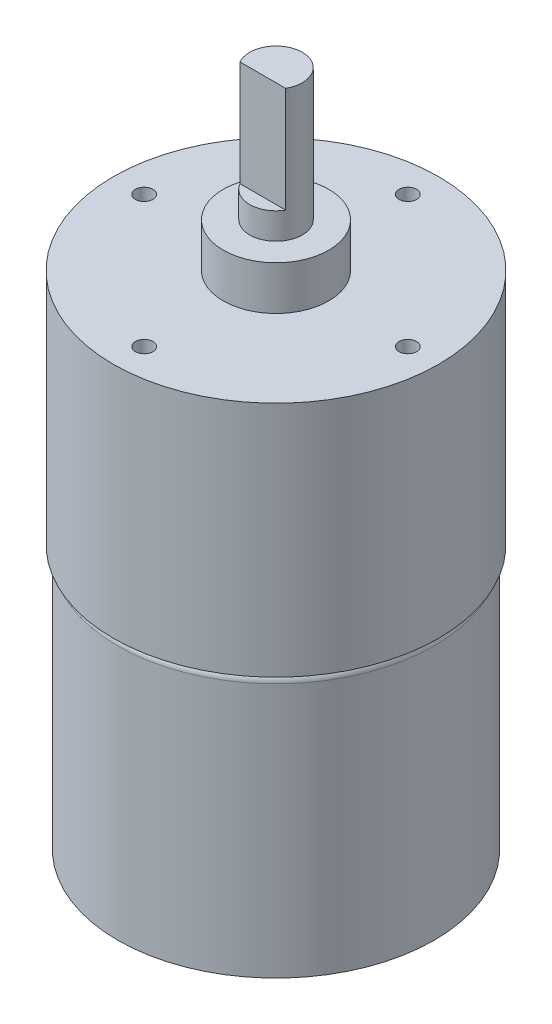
from build123d import *

# Parameters (mm, degrees)
SKETCH1_R               = 18
BOSS_EXTRUDE1_DEPTH     = 30
SKETCH2_R               = 17.5
CUT_EXTRUDE1_DEPTH      = 1
BOSS_EXTRUDE3_DEPTH     = 6
SKETCH3_3_R             = 0.5
BOSS_EXTRUDE4_DEPTH     = 0.5
CUT_EXTRUDE2_DEPTH      = 46.762976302
CUT_EXTRUDE2_DEPTH_BACK = 46.762976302
CHAMFER1_SIZE           = 0.1
FILLET1_R               = 1
SKETCH6_R               = 18.5
BOSS_EXTRUDE5_DEPTH     = 27
SKETCH7_R               = 6
BOSS_EXTRUDE6_DEPTH     = 5
SKETCH8_R               = 3
BOSS_EXTRUDE7_DEPTH     = 15
SKETCH9_W               = 5.196152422
SKETCH9_H               = 2
CUT_EXTRUDE3_DEPTH      = 12
SKETCH10_R              = 1
CUT_EXTRUDE4_DEPTH      = 12
CIRPATTERN1_COUNT       = 4


with BuildPart() as part:
    # Sketch1 → Boss-Extrude1 (new body)
    with BuildSketch(Plane(origin=(0, 0, 0), x_dir=(1, 0, 0), z_dir=(0, 1, 0))):
        with Locations(Location((0, 0, 0), (0, 0, 270))):
            Circle(SKETCH1_R)
    extrude(amount=BOSS_EXTRUDE1_DEPTH)

    # Sketch2 → Cut-Extrude1 (cut)
    with BuildSketch(Plane.XZ):
        with Locations(Location((0, 0, 0), (0, 0, 270))):
            Circle(SKETCH2_R)
    extrude(amount=-CUT_EXTRUDE1_DEPTH, mode=Mode.SUBTRACT)

    # Sketch3 → Boss-Extrude3 (add)
    with BuildSketch(Plane.XZ.offset(-1)):
        with BuildLine():
            Line((-10.5, -1.5), (-10.5, 1.5))
            ThreePointArc((-10.5, 1.5), (-11, 2), (-11.5, 1.5))
            Line((-11.5, 1.5), (-11.5, -1.5))
            ThreePointArc((-11.5, -1.5), (-11, -2), (-10.5, -1.5))
        make_face()
        with BuildLine():
            Line((11.5, -1.5), (11.5, 1.5))
            ThreePointArc((11.5, 1.5), (11, 2), (10.5, 1.5))
            Line((10.5, 1.5), (10.5, -1.5))
            ThreePointArc((10.5, -1.5), (11, -2), (11.5, -1.5))
        make_face()
    extrude(amount=BOSS_EXTRUDE3_DEPTH)

    # Sketch3_3 → Boss-Extrude4 (add)
    with BuildSketch(Plane.XZ.offset(-1)):
        with Locations(Location((10.5, 3, 0), (0, 0, 270))):
            Circle(SKETCH3_3_R)
        with Locations(Location((10.5, -3, 0), (0, 0, 90))):
            Circle(SKETCH3_3_R)
        with Locations(Location((-10.5, -3, 0), (0, 0, 270))):
            Circle(SKETCH3_3_R)
        with Locations(Location((-10.5, 3, 0), (0, 0, 90))):
            Circle(SKETCH3_3_R)
    extrude(amount=BOSS_EXTRUDE4_DEPTH)

    # Sketch4 → Cut-Extrude2 (cut, two sides: drawn at the far end of the back side and taken through both)
    with BuildSketch(Plane(origin=(11.5, 0, 0), x_dir=(0, 0, -1), z_dir=(1, 0, 0)).offset(-CUT_EXTRUDE2_DEPTH_BACK)):
        with BuildLine():
            Line((0.5, -1.75), (0.5, -3.25))
            ThreePointArc((0.5, -3.25), (0, -3.75), (-0.5, -3.25))
            Line((-0.5, -3.25), (-0.5, -1.75))
            ThreePointArc((-0.5, -1.75), (0, -1.25), (0.5, -1.75))
        make_face()
    extrude(amount=CUT_EXTRUDE2_DEPTH + CUT_EXTRUDE2_DEPTH_BACK, mode=Mode.SUBTRACT)

    # Chamfer1
    chamfer1_edges = [part.edges().sort_by_distance(p)[0] for p in [
        (-11.5, -5, 0),
        (-10.5, -5, 0),
        (-11, -5, 2),
        (-11, -5, -2),
        (10.5, -5, 0),
        (11.5, -5, 0),
        (11, -5, 2),
        (11, -5, -2),
    ]]
    chamfer(chamfer1_edges, length=CHAMFER1_SIZE)

    # Fillet1
    fillet1_edges = [part.edges().sort_by_distance(p)[0] for p in [
        (0, 30, -18),
    ]]
    fillet(fillet1_edges, radius=FILLET1_R)

    # Sketch6 → Boss-Extrude5 (add)
    with BuildSketch(Plane(origin=(0, 30, 0), x_dir=(1, 0, 0), z_dir=(0, 1, 0))):
        with Locations(Location((0, 0, 0), (0, 0, 270))):
            Circle(SKETCH6_R)
    extrude(amount=BOSS_EXTRUDE5_DEPTH)

    # Sketch7 → Boss-Extrude6 (add)
    with BuildSketch(Plane(origin=(0, 57, 0), x_dir=(1, 0, 0), z_dir=(0, 1, 0))):
        with Locations(Location((0, 0, 0), (0, 0, 270))):
            Circle(SKETCH7_R)
    extrude(amount=BOSS_EXTRUDE6_DEPTH)

    # Sketch8 → Boss-Extrude7 (add)
    with BuildSketch(Plane(origin=(0, 62, 0), x_dir=(1, 0, 0), z_dir=(0, 1, 0))):
        with Locations(Location((0, 0, 0), (0, 0, 270))):
            Circle(SKETCH8_R)
    extrude(amount=BOSS_EXTRUDE7_DEPTH)

    # Sketch9 → Cut-Extrude3 (cut)
    with BuildSketch(Plane(origin=(0, 77, 0), x_dir=(1, 0, 0), z_dir=(0, 1, 0))):
        with Locations((0, -2.5)):
            Rectangle(SKETCH9_W, SKETCH9_H)
    extrude(amount=-CUT_EXTRUDE3_DEPTH, mode=Mode.SUBTRACT)

    # Sketch10 → Cut-Extrude4 (cut)
    with BuildSketch(Plane(origin=(0, 57, 0), x_dir=(1, 0, 0), z_dir=(0, 1, 0))):
        with Locations(Location((0, 15, 0), (0, 0, 270))):
            Circle(SKETCH10_R)
    cut_extrude4 = extrude(amount=-CUT_EXTRUDE4_DEPTH, mode=Mode.SUBTRACT)

    # CirPattern1: Cut-Extrude4 ×4 about axis
    cirpattern1_axis = Axis((0, 0, 0), (0, 1, 0))
    for i in range(1, CIRPATTERN1_COUNT):
        add(cut_extrude4.rotate(cirpattern1_axis, i * 360 / CIRPATTERN1_COUNT), mode=Mode.SUBTRACT)


with BuildPart() as body_2:
    # Sketch5 → Revolve1 (revolve)
    with BuildSketch(Plane.XY, mode=Mode.PRIVATE) as revolve1_sk:
        Polygon((5, 0), (5, -3), (4, -4), (3.5, -4), (3.5, -3.6), (0, -3.6), (0, 0), align=None)
    revolve(revolve1_sk.sketch.rotate(Axis((0, 0, 0), (0, -1, 0)), 180), axis=Axis((0, 0, 0), (0, -1, 0)))


solid = Compound([part.part, body_2.part])
